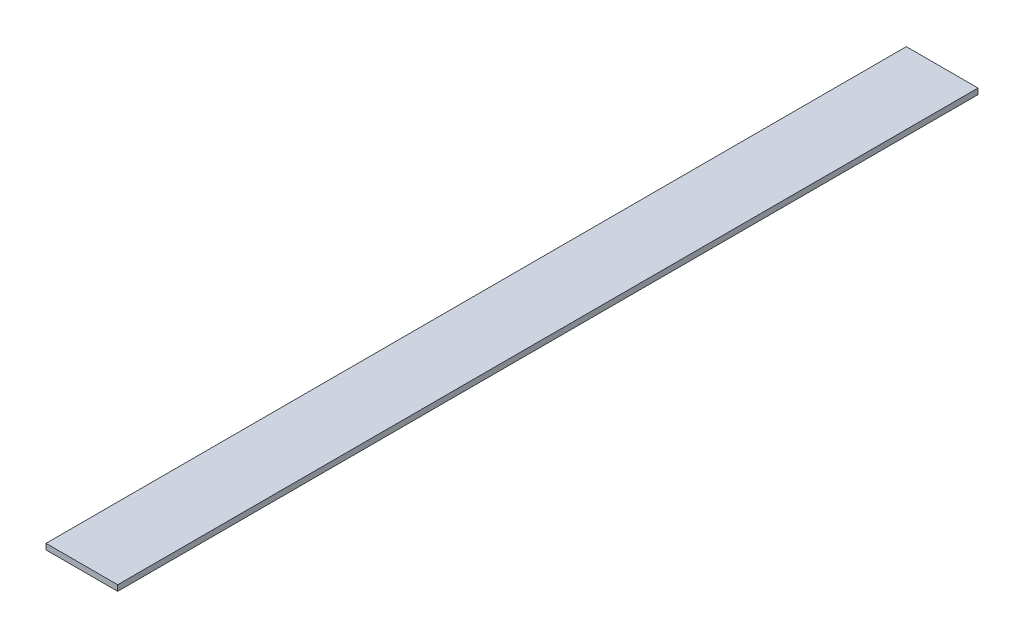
ISO-10303-21;
HEADER;
FILE_DESCRIPTION(('STEP AP214'),'2;1');
FILE_NAME('part.step','',(''),(''),'','','');
FILE_SCHEMA(('AUTOMOTIVE_DESIGN { 1 0 10303 214 1 1 1 1 }'));
ENDSEC;
DATA;
#1=APPLICATION_CONTEXT('core data for automotive mechanical design processes');
#2=APPLICATION_PROTOCOL_DEFINITION('international standard','automotive_design',2000,#1);
#3=PRODUCT_CONTEXT('',#1,'mechanical');
#4=PRODUCT('Part','Part','',(#3));
#5=PRODUCT_RELATED_PRODUCT_CATEGORY('part','',(#4));
#6=PRODUCT_DEFINITION_FORMATION('','',#4);
#7=PRODUCT_DEFINITION_CONTEXT('part definition',#1,'design');
#8=PRODUCT_DEFINITION('design','',#6,#7);
#9=PRODUCT_DEFINITION_SHAPE('','',#8);
#10=(LENGTH_UNIT() NAMED_UNIT(*) SI_UNIT(.MILLI.,.METRE.));
#11=(NAMED_UNIT(*) PLANE_ANGLE_UNIT() SI_UNIT($,.RADIAN.));
#12=(NAMED_UNIT(*) SI_UNIT($,.STERADIAN.) SOLID_ANGLE_UNIT());
#13=UNCERTAINTY_MEASURE_WITH_UNIT(LENGTH_MEASURE(1.E-05),#10,'distance_accuracy_value','');
#14=(GEOMETRIC_REPRESENTATION_CONTEXT(3) GLOBAL_UNCERTAINTY_ASSIGNED_CONTEXT((#13)) GLOBAL_UNIT_ASSIGNED_CONTEXT((#10,
#11,#12)) REPRESENTATION_CONTEXT('',''));
#15=CARTESIAN_POINT('',(0.,0.,0.));
#16=DIRECTION('',(0.,0.,1.));
#17=DIRECTION('',(1.,0.,0.));
#18=AXIS2_PLACEMENT_3D('',#15,#16,#17);
#19=CARTESIAN_POINT('',(25.4000000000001,4.064,304.8));
#20=DIRECTION('',(-1.,0.,0.));
#21=DIRECTION('',(0.,0.,1.));
#22=AXIS2_PLACEMENT_3D('',#19,#20,#21);
#23=PLANE('',#22);
#24=DIRECTION('',(0.,0.,-1.));
#25=VECTOR('',#24,1.);
#26=CARTESIAN_POINT('',(25.4000000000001,0.,304.8));
#27=LINE('',#26,#25);
#28=CARTESIAN_POINT('',(25.4000000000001,0.,304.8));
#29=VERTEX_POINT('',#28);
#30=CARTESIAN_POINT('',(25.4000000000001,0.,-304.8));
#31=VERTEX_POINT('',#30);
#32=EDGE_CURVE('E106',#29,#31,#27,.T.);
#33=ORIENTED_EDGE('',*,*,#32,.T.);
#34=DIRECTION('',(0.,-1.,0.));
#35=VECTOR('',#34,1.);
#36=CARTESIAN_POINT('',(25.4000000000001,4.064,-304.8));
#37=LINE('',#36,#35);
#38=CARTESIAN_POINT('',(25.4000000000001,4.064,-304.8));
#39=VERTEX_POINT('',#38);
#40=EDGE_CURVE('E11',#39,#31,#37,.T.);
#41=ORIENTED_EDGE('',*,*,#40,.F.);
#42=DIRECTION('',(0.,0.,-1.));
#43=VECTOR('',#42,1.);
#44=CARTESIAN_POINT('',(25.4000000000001,4.064,304.8));
#45=LINE('',#44,#43);
#46=CARTESIAN_POINT('',(25.4000000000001,4.064,304.8));
#47=VERTEX_POINT('',#46);
#48=EDGE_CURVE('E94',#47,#39,#45,.T.);
#49=ORIENTED_EDGE('',*,*,#48,.F.);
#50=DIRECTION('',(0.,-1.,0.));
#51=VECTOR('',#50,1.);
#52=CARTESIAN_POINT('',(25.4000000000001,4.064,304.8));
#53=LINE('',#52,#51);
#54=EDGE_CURVE('E102',#47,#29,#53,.T.);
#55=ORIENTED_EDGE('',*,*,#54,.T.);
#56=EDGE_LOOP('',(#33,#41,#49,#55));
#57=FACE_BOUND('',#56,.T.);
#58=ADVANCED_FACE('F43',(#57),#23,.F.);
#59=CARTESIAN_POINT('',(-25.4000000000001,4.064,-304.8));
#60=DIRECTION('',(0.,0.,1.));
#61=DIRECTION('',(1.,0.,0.));
#62=AXIS2_PLACEMENT_3D('',#59,#60,#61);
#63=PLANE('',#62);
#64=DIRECTION('',(-1.,0.,0.));
#65=VECTOR('',#64,1.);
#66=CARTESIAN_POINT('',(-25.4000000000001,0.,-304.8));
#67=LINE('',#66,#65);
#68=CARTESIAN_POINT('',(-25.4000000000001,0.,-304.8));
#69=VERTEX_POINT('',#68);
#70=EDGE_CURVE('E98',#31,#69,#67,.T.);
#71=ORIENTED_EDGE('',*,*,#70,.T.);
#72=DIRECTION('',(0.,-1.,0.));
#73=VECTOR('',#72,1.);
#74=CARTESIAN_POINT('',(-25.4000000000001,4.064,-304.8));
#75=LINE('',#74,#73);
#76=CARTESIAN_POINT('',(-25.4000000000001,4.064,-304.8));
#77=VERTEX_POINT('',#76);
#78=EDGE_CURVE('E51',#77,#69,#75,.T.);
#79=ORIENTED_EDGE('',*,*,#78,.F.);
#80=DIRECTION('',(-1.,0.,0.));
#81=VECTOR('',#80,1.);
#82=CARTESIAN_POINT('',(-25.4000000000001,4.064,-304.8));
#83=LINE('',#82,#81);
#84=EDGE_CURVE('E89',#39,#77,#83,.T.);
#85=ORIENTED_EDGE('',*,*,#84,.F.);
#86=ORIENTED_EDGE('',*,*,#40,.T.);
#87=EDGE_LOOP('',(#71,#79,#85,#86));
#88=FACE_BOUND('',#87,.T.);
#89=ADVANCED_FACE('F97',(#88),#63,.F.);
#90=CARTESIAN_POINT('',(-25.4000000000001,4.064,304.8));
#91=DIRECTION('',(1.,0.,0.));
#92=DIRECTION('',(0.,0.,-1.));
#93=AXIS2_PLACEMENT_3D('',#90,#91,#92);
#94=PLANE('',#93);
#95=DIRECTION('',(0.,0.,1.));
#96=VECTOR('',#95,1.);
#97=CARTESIAN_POINT('',(-25.4000000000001,0.,304.8));
#98=LINE('',#97,#96);
#99=CARTESIAN_POINT('',(-25.4000000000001,0.,304.8));
#100=VERTEX_POINT('',#99);
#101=EDGE_CURVE('E76',#69,#100,#98,.T.);
#102=ORIENTED_EDGE('',*,*,#101,.T.);
#103=DIRECTION('',(0.,-1.,0.));
#104=VECTOR('',#103,1.);
#105=CARTESIAN_POINT('',(-25.4000000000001,4.064,304.8));
#106=LINE('',#105,#104);
#107=CARTESIAN_POINT('',(-25.4000000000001,4.064,304.8));
#108=VERTEX_POINT('',#107);
#109=EDGE_CURVE('E99',#108,#100,#106,.T.);
#110=ORIENTED_EDGE('',*,*,#109,.F.);
#111=DIRECTION('',(0.,0.,1.));
#112=VECTOR('',#111,1.);
#113=CARTESIAN_POINT('',(-25.4000000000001,4.064,304.8));
#114=LINE('',#113,#112);
#115=EDGE_CURVE('E92',#77,#108,#114,.T.);
#116=ORIENTED_EDGE('',*,*,#115,.F.);
#117=ORIENTED_EDGE('',*,*,#78,.T.);
#118=EDGE_LOOP('',(#102,#110,#116,#117));
#119=FACE_BOUND('',#118,.T.);
#120=ADVANCED_FACE('F100',(#119),#94,.F.);
#121=CARTESIAN_POINT('',(-25.4000000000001,4.064,304.8));
#122=DIRECTION('',(0.,0.,-1.));
#123=DIRECTION('',(-1.,0.,0.));
#124=AXIS2_PLACEMENT_3D('',#121,#122,#123);
#125=PLANE('',#124);
#126=DIRECTION('',(1.,0.,0.));
#127=VECTOR('',#126,1.);
#128=CARTESIAN_POINT('',(-25.4000000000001,0.,304.8));
#129=LINE('',#128,#127);
#130=EDGE_CURVE('E82',#100,#29,#129,.T.);
#131=ORIENTED_EDGE('',*,*,#130,.T.);
#132=ORIENTED_EDGE('',*,*,#54,.F.);
#133=DIRECTION('',(1.,0.,0.));
#134=VECTOR('',#133,1.);
#135=CARTESIAN_POINT('',(-25.4000000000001,4.064,304.8));
#136=LINE('',#135,#134);
#137=EDGE_CURVE('E59',#108,#47,#136,.T.);
#138=ORIENTED_EDGE('',*,*,#137,.F.);
#139=ORIENTED_EDGE('',*,*,#109,.T.);
#140=EDGE_LOOP('',(#131,#132,#138,#139));
#141=FACE_BOUND('',#140,.T.);
#142=ADVANCED_FACE('F113',(#141),#125,.F.);
#143=CARTESIAN_POINT('',(0.,4.064,0.));
#144=DIRECTION('',(0.,-1.,0.));
#145=DIRECTION('',(0.,0.,-1.));
#146=AXIS2_PLACEMENT_3D('',#143,#144,#145);
#147=PLANE('',#146);
#148=ORIENTED_EDGE('',*,*,#48,.T.);
#149=ORIENTED_EDGE('',*,*,#84,.T.);
#150=ORIENTED_EDGE('',*,*,#115,.T.);
#151=ORIENTED_EDGE('',*,*,#137,.T.);
#152=EDGE_LOOP('',(#148,#149,#150,#151));
#153=FACE_BOUND('',#152,.T.);
#154=ADVANCED_FACE('F90',(#153),#147,.F.);
#155=CARTESIAN_POINT('',(0.,0.,0.));
#156=DIRECTION('',(0.,-1.,0.));
#157=DIRECTION('',(0.,0.,-1.));
#158=AXIS2_PLACEMENT_3D('',#155,#156,#157);
#159=PLANE('',#158);
#160=ORIENTED_EDGE('',*,*,#32,.F.);
#161=ORIENTED_EDGE('',*,*,#130,.F.);
#162=ORIENTED_EDGE('',*,*,#101,.F.);
#163=ORIENTED_EDGE('',*,*,#70,.F.);
#164=EDGE_LOOP('',(#160,#161,#162,#163));
#165=FACE_BOUND('',#164,.T.);
#166=ADVANCED_FACE('F116',(#165),#159,.T.);
#167=CLOSED_SHELL('',(#58,#89,#120,#142,#154,#166));
#168=MANIFOLD_SOLID_BREP('B2',#167);
#169=ADVANCED_BREP_SHAPE_REPRESENTATION('',(#18,#168),#14);
#170=SHAPE_DEFINITION_REPRESENTATION(#9,#169);
ENDSEC;
END-ISO-10303-21;
